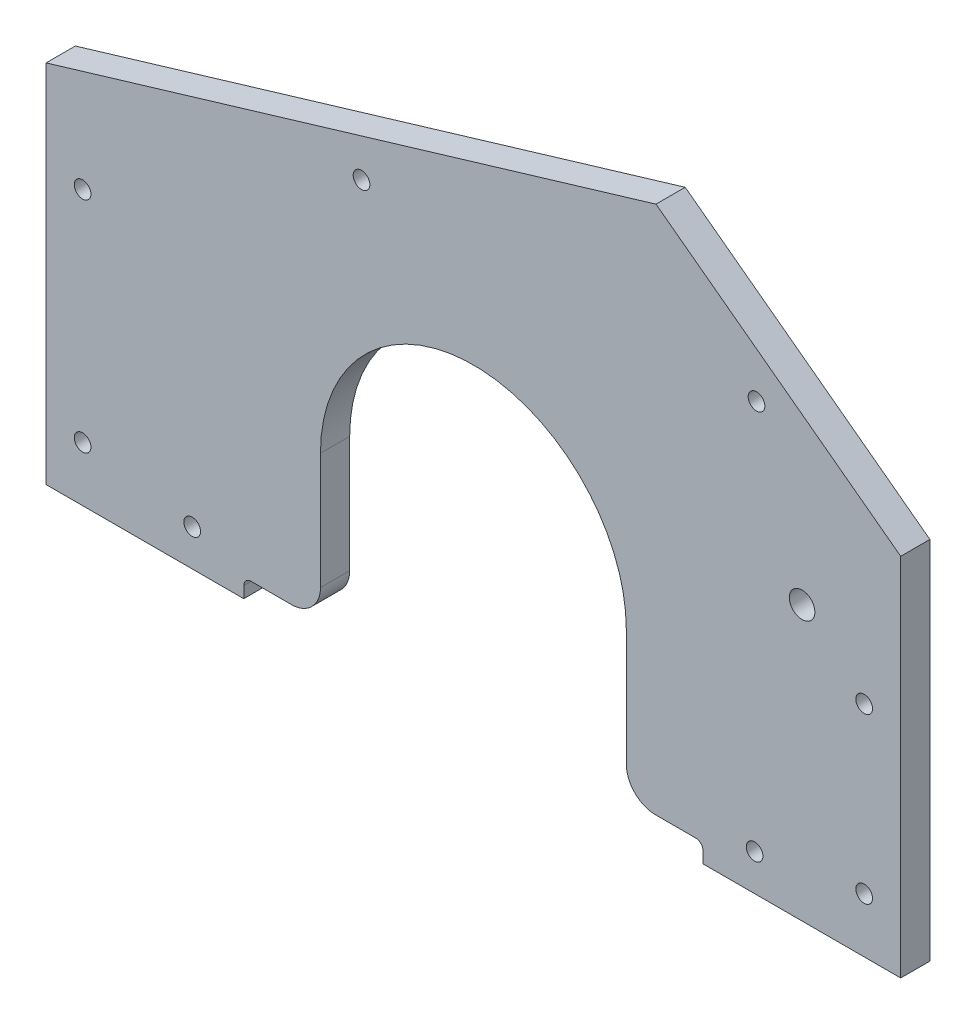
ISO-10303-21;
HEADER;
FILE_DESCRIPTION(('STEP AP214'),'2;1');
FILE_NAME('part.step','',(''),(''),'','','');
FILE_SCHEMA(('AUTOMOTIVE_DESIGN { 1 0 10303 214 1 1 1 1 }'));
ENDSEC;
DATA;
#1=APPLICATION_CONTEXT('core data for automotive mechanical design processes');
#2=APPLICATION_PROTOCOL_DEFINITION('international standard','automotive_design',2000,#1);
#3=PRODUCT_CONTEXT('',#1,'mechanical');
#4=PRODUCT('Part','Part','',(#3));
#5=PRODUCT_RELATED_PRODUCT_CATEGORY('part','',(#4));
#6=PRODUCT_DEFINITION_FORMATION('','',#4);
#7=PRODUCT_DEFINITION_CONTEXT('part definition',#1,'design');
#8=PRODUCT_DEFINITION('design','',#6,#7);
#9=PRODUCT_DEFINITION_SHAPE('','',#8);
#10=(LENGTH_UNIT() NAMED_UNIT(*) SI_UNIT(.MILLI.,.METRE.));
#11=(NAMED_UNIT(*) PLANE_ANGLE_UNIT() SI_UNIT($,.RADIAN.));
#12=(NAMED_UNIT(*) SI_UNIT($,.STERADIAN.) SOLID_ANGLE_UNIT());
#13=UNCERTAINTY_MEASURE_WITH_UNIT(LENGTH_MEASURE(1.E-05),#10,'distance_accuracy_value','');
#14=(GEOMETRIC_REPRESENTATION_CONTEXT(3) GLOBAL_UNCERTAINTY_ASSIGNED_CONTEXT((#13)) GLOBAL_UNIT_ASSIGNED_CONTEXT((#10,
#11,#12)) REPRESENTATION_CONTEXT('',''));
#15=CARTESIAN_POINT('',(0.,0.,0.));
#16=DIRECTION('',(0.,0.,1.));
#17=DIRECTION('',(1.,0.,0.));
#18=AXIS2_PLACEMENT_3D('',#15,#16,#17);
#19=CARTESIAN_POINT('',(98.7933930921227,-69.6734749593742,-8.));
#20=DIRECTION('',(0.,-1.,0.));
#21=DIRECTION('',(1.,0.,0.));
#22=AXIS2_PLACEMENT_3D('',#19,#20,#21);
#23=PLANE('',#22);
#24=DIRECTION('',(1.,0.,0.));
#25=VECTOR('',#24,1.);
#26=CARTESIAN_POINT('',(98.7933930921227,-69.6734749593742,-8.));
#27=LINE('',#26,#25);
#28=CARTESIAN_POINT('',(-135.206606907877,-69.6734749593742,-8.));
#29=VERTEX_POINT('',#28);
#30=CARTESIAN_POINT('',(-81.0816069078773,-69.6734749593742,-8.));
#31=VERTEX_POINT('',#30);
#32=EDGE_CURVE('E379',#29,#31,#27,.T.);
#33=ORIENTED_EDGE('',*,*,#32,.T.);
#34=DIRECTION('',(0.,0.,1.));
#35=VECTOR('',#34,1.);
#36=CARTESIAN_POINT('',(-81.0816069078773,-69.6734749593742,-8.));
#37=LINE('',#36,#35);
#38=CARTESIAN_POINT('',(-81.0816069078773,-69.6734749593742,0.));
#39=VERTEX_POINT('',#38);
#40=EDGE_CURVE('E319',#31,#39,#37,.T.);
#41=ORIENTED_EDGE('',*,*,#40,.T.);
#42=DIRECTION('',(1.,0.,0.));
#43=VECTOR('',#42,1.);
#44=CARTESIAN_POINT('',(98.7933930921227,-69.6734749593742,0.));
#45=LINE('',#44,#43);
#46=CARTESIAN_POINT('',(-135.206606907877,-69.6734749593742,0.));
#47=VERTEX_POINT('',#46);
#48=EDGE_CURVE('E395',#47,#39,#45,.T.);
#49=ORIENTED_EDGE('',*,*,#48,.F.);
#50=DIRECTION('',(0.,0.,1.));
#51=VECTOR('',#50,1.);
#52=CARTESIAN_POINT('',(-135.206606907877,-69.6734749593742,-8.));
#53=LINE('',#52,#51);
#54=EDGE_CURVE('E173',#29,#47,#53,.T.);
#55=ORIENTED_EDGE('',*,*,#54,.F.);
#56=EDGE_LOOP('',(#33,#41,#49,#55));
#57=FACE_BOUND('',#56,.T.);
#58=ADVANCED_FACE('F41',(#57),#23,.T.);
#59=CARTESIAN_POINT('',(44.6683930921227,-69.6734749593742,0.));
#60=VERTEX_POINT('',#59);
#61=CARTESIAN_POINT('',(98.7933930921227,-69.6734749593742,0.));
#62=VERTEX_POINT('',#61);
#63=EDGE_CURVE('E376',#60,#62,#45,.T.);
#64=ORIENTED_EDGE('',*,*,#63,.F.);
#65=DIRECTION('',(0.,0.,-1.));
#66=VECTOR('',#65,1.);
#67=CARTESIAN_POINT('',(44.6683930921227,-69.6734749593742,-8.));
#68=LINE('',#67,#66);
#69=CARTESIAN_POINT('',(44.6683930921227,-69.6734749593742,-8.));
#70=VERTEX_POINT('',#69);
#71=EDGE_CURVE('E314',#60,#70,#68,.T.);
#72=ORIENTED_EDGE('',*,*,#71,.T.);
#73=CARTESIAN_POINT('',(98.7933930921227,-69.6734749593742,-8.));
#74=VERTEX_POINT('',#73);
#75=EDGE_CURVE('E382',#70,#74,#27,.T.);
#76=ORIENTED_EDGE('',*,*,#75,.T.);
#77=DIRECTION('',(0.,0.,1.));
#78=VECTOR('',#77,1.);
#79=CARTESIAN_POINT('',(98.7933930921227,-69.6734749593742,-8.));
#80=LINE('',#79,#78);
#81=EDGE_CURVE('E394',#74,#62,#80,.T.);
#82=ORIENTED_EDGE('',*,*,#81,.T.);
#83=EDGE_LOOP('',(#64,#72,#76,#82));
#84=FACE_BOUND('',#83,.T.);
#85=ADVANCED_FACE('F259',(#84),#23,.T.);
#86=CARTESIAN_POINT('',(0.,0.,-8.));
#87=DIRECTION('',(0.,0.,-1.));
#88=DIRECTION('',(-1.,0.,0.));
#89=AXIS2_PLACEMENT_3D('',#86,#87,#88);
#90=PLANE('',#89);
#91=CARTESIAN_POINT('',(71.7933930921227,5.32652504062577,-8.));
#92=DIRECTION('',(0.,0.,-1.));
#93=DIRECTION('',(-1.,0.,0.));
#94=AXIS2_PLACEMENT_3D('',#91,#92,#93);
#95=CIRCLE('',#94,17.);
#96=CARTESIAN_POINT('',(54.7933930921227,5.32652504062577,-8.));
#97=VERTEX_POINT('',#96);
#98=EDGE_CURVE('E11',#97,#97,#95,.F.);
#99=ORIENTED_EDGE('',*,*,#98,.T.);
#100=EDGE_LOOP('',(#99));
#101=FACE_BOUND('',#100,.T.);
#102=CARTESIAN_POINT('',(88.7933930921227,-9.67347495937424,-8.));
#103=DIRECTION('',(0.,0.,1.));
#104=DIRECTION('',(1.,0.,0.));
#105=AXIS2_PLACEMENT_3D('',#102,#103,#104);
#106=CIRCLE('',#105,2.28499999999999);
#107=CARTESIAN_POINT('',(91.0783930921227,-9.67347495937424,-8.));
#108=VERTEX_POINT('',#107);
#109=EDGE_CURVE('E331',#108,#108,#106,.T.);
#110=ORIENTED_EDGE('',*,*,#109,.T.);
#111=EDGE_LOOP('',(#110));
#112=FACE_BOUND('',#111,.T.);
#113=CARTESIAN_POINT('',(-48.8383912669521,45.7466847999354,-8.));
#114=DIRECTION('',(0.,0.,1.));
#115=DIRECTION('',(1.,0.,0.));
#116=AXIS2_PLACEMENT_3D('',#113,#114,#115);
#117=CIRCLE('',#116,2.285);
#118=CARTESIAN_POINT('',(-46.5533912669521,45.7466847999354,-8.));
#119=VERTEX_POINT('',#118);
#120=EDGE_CURVE('E337',#119,#119,#117,.T.);
#121=ORIENTED_EDGE('',*,*,#120,.T.);
#122=EDGE_LOOP('',(#121));
#123=FACE_BOUND('',#122,.T.);
#124=CARTESIAN_POINT('',(59.3125489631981,47.3121939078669,-8.));
#125=DIRECTION('',(0.,0.,1.));
#126=DIRECTION('',(1.,0.,0.));
#127=AXIS2_PLACEMENT_3D('',#124,#125,#126);
#128=CIRCLE('',#127,2.28499999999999);
#129=CARTESIAN_POINT('',(61.5975489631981,47.3121939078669,-8.));
#130=VERTEX_POINT('',#129);
#131=EDGE_CURVE('E343',#130,#130,#128,.T.);
#132=ORIENTED_EDGE('',*,*,#131,.T.);
#133=EDGE_LOOP('',(#132));
#134=FACE_BOUND('',#133,.T.);
#135=CARTESIAN_POINT('',(88.7933930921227,-54.6734749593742,-8.));
#136=DIRECTION('',(0.,0.,1.));
#137=DIRECTION('',(1.,0.,0.));
#138=AXIS2_PLACEMENT_3D('',#135,#136,#137);
#139=CIRCLE('',#138,2.28499999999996);
#140=CARTESIAN_POINT('',(91.0783930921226,-54.6734749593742,-8.));
#141=VERTEX_POINT('',#140);
#142=EDGE_CURVE('E349',#141,#141,#139,.T.);
#143=ORIENTED_EDGE('',*,*,#142,.T.);
#144=EDGE_LOOP('',(#143));
#145=FACE_BOUND('',#144,.T.);
#146=CARTESIAN_POINT('',(58.7933930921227,-59.6734749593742,-8.));
#147=DIRECTION('',(0.,0.,1.));
#148=DIRECTION('',(-1.,0.,0.));
#149=AXIS2_PLACEMENT_3D('',#146,#147,#148);
#150=CIRCLE('',#149,2.285);
#151=CARTESIAN_POINT('',(56.5083930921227,-59.6734749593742,-8.));
#152=VERTEX_POINT('',#151);
#153=EDGE_CURVE('E355',#152,#152,#150,.T.);
#154=ORIENTED_EDGE('',*,*,#153,.T.);
#155=EDGE_LOOP('',(#154));
#156=FACE_BOUND('',#155,.T.);
#157=CARTESIAN_POINT('',(-95.2066069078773,-59.6734749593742,-8.));
#158=DIRECTION('',(0.,0.,1.));
#159=DIRECTION('',(1.,0.,0.));
#160=AXIS2_PLACEMENT_3D('',#157,#158,#159);
#161=CIRCLE('',#160,2.285);
#162=CARTESIAN_POINT('',(-92.9216069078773,-59.6734749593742,-8.));
#163=VERTEX_POINT('',#162);
#164=EDGE_CURVE('E361',#163,#163,#161,.T.);
#165=ORIENTED_EDGE('',*,*,#164,.T.);
#166=EDGE_LOOP('',(#165));
#167=FACE_BOUND('',#166,.T.);
#168=CARTESIAN_POINT('',(-125.206606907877,-54.6734749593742,-8.));
#169=DIRECTION('',(0.,0.,1.));
#170=DIRECTION('',(-1.,0.,0.));
#171=AXIS2_PLACEMENT_3D('',#168,#169,#170);
#172=CIRCLE('',#171,2.28499999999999);
#173=CARTESIAN_POINT('',(-127.491606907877,-54.6734749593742,-8.));
#174=VERTEX_POINT('',#173);
#175=EDGE_CURVE('E367',#174,#174,#172,.T.);
#176=ORIENTED_EDGE('',*,*,#175,.T.);
#177=EDGE_LOOP('',(#176));
#178=FACE_BOUND('',#177,.T.);
#179=CARTESIAN_POINT('',(-125.206606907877,5.32652504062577,-8.));
#180=DIRECTION('',(0.,0.,1.));
#181=DIRECTION('',(1.,0.,0.));
#182=AXIS2_PLACEMENT_3D('',#179,#180,#181);
#183=CIRCLE('',#182,2.28499999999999);
#184=CARTESIAN_POINT('',(-122.921606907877,5.32652504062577,-8.));
#185=VERTEX_POINT('',#184);
#186=EDGE_CURVE('E373',#185,#185,#183,.T.);
#187=ORIENTED_EDGE('',*,*,#186,.T.);
#188=EDGE_LOOP('',(#187));
#189=FACE_BOUND('',#188,.T.);
#190=DIRECTION('',(0.,-1.,0.));
#191=VECTOR('',#190,1.);
#192=CARTESIAN_POINT('',(-60.0816069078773,0.,-8.));
#193=LINE('',#192,#191);
#194=CARTESIAN_POINT('',(-60.0816069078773,-24.6734749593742,-8.));
#195=VERTEX_POINT('',#194);
#196=CARTESIAN_POINT('',(-60.0816069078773,-56.5434749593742,-8.));
#197=VERTEX_POINT('',#196);
#198=EDGE_CURVE('E303',#195,#197,#193,.T.);
#199=ORIENTED_EDGE('',*,*,#198,.T.);
#200=CARTESIAN_POINT('',(-68.0816069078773,-56.5434749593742,-8.));
#201=DIRECTION('',(0.,0.,-1.));
#202=DIRECTION('',(-1.,0.,0.));
#203=AXIS2_PLACEMENT_3D('',#200,#201,#202);
#204=CIRCLE('',#203,8.);
#205=CARTESIAN_POINT('',(-68.0816069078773,-64.5434749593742,-8.));
#206=VERTEX_POINT('',#205);
#207=EDGE_CURVE('E215',#197,#206,#204,.T.);
#208=ORIENTED_EDGE('',*,*,#207,.T.);
#209=DIRECTION('',(-1.,0.,0.));
#210=VECTOR('',#209,1.);
#211=CARTESIAN_POINT('',(0.,-64.5434749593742,-8.));
#212=LINE('',#211,#210);
#213=CARTESIAN_POINT('',(-79.0816069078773,-64.5434749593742,-8.));
#214=VERTEX_POINT('',#213);
#215=EDGE_CURVE('E298',#206,#214,#212,.T.);
#216=ORIENTED_EDGE('',*,*,#215,.T.);
#217=CARTESIAN_POINT('',(-79.0816069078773,-66.5434749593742,-8.));
#218=DIRECTION('',(0.,0.,-1.));
#219=DIRECTION('',(-1.,0.,0.));
#220=AXIS2_PLACEMENT_3D('',#217,#218,#219);
#221=CIRCLE('',#220,2.);
#222=CARTESIAN_POINT('',(-81.0816069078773,-66.5434749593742,-8.));
#223=VERTEX_POINT('',#222);
#224=EDGE_CURVE('E236',#214,#223,#221,.F.);
#225=ORIENTED_EDGE('',*,*,#224,.T.);
#226=DIRECTION('',(0.,-1.,0.));
#227=VECTOR('',#226,1.);
#228=CARTESIAN_POINT('',(-81.0816069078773,0.,-8.));
#229=LINE('',#228,#227);
#230=EDGE_CURVE('E322',#223,#31,#229,.T.);
#231=ORIENTED_EDGE('',*,*,#230,.T.);
#232=ORIENTED_EDGE('',*,*,#32,.F.);
#233=DIRECTION('',(0.,-1.,0.));
#234=VECTOR('',#233,1.);
#235=CARTESIAN_POINT('',(-135.206606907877,-69.6734749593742,-8.));
#236=LINE('',#235,#234);
#237=CARTESIAN_POINT('',(-135.206606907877,30.3265250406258,-8.));
#238=VERTEX_POINT('',#237);
#239=EDGE_CURVE('E391',#238,#29,#236,.T.);
#240=ORIENTED_EDGE('',*,*,#239,.F.);
#241=DIRECTION('',(-0.957984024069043,-0.286821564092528,0.));
#242=VECTOR('',#241,1.);
#243=CARTESIAN_POINT('',(-135.206606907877,30.3265250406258,-8.));
#244=LINE('',#243,#242);
#245=CARTESIAN_POINT('',(31.7933930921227,80.3265250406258,-8.));
#246=VERTEX_POINT('',#245);
#247=EDGE_CURVE('E388',#246,#238,#244,.T.);
#248=ORIENTED_EDGE('',*,*,#247,.F.);
#249=DIRECTION('',(-0.801433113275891,0.598084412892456,0.));
#250=VECTOR('',#249,1.);
#251=CARTESIAN_POINT('',(31.7933930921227,80.3265250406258,-8.));
#252=LINE('',#251,#250);
#253=CARTESIAN_POINT('',(98.7933930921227,30.3265250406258,-8.));
#254=VERTEX_POINT('',#253);
#255=EDGE_CURVE('E385',#254,#246,#252,.T.);
#256=ORIENTED_EDGE('',*,*,#255,.F.);
#257=DIRECTION('',(0.,1.,0.));
#258=VECTOR('',#257,1.);
#259=CARTESIAN_POINT('',(98.7933930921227,30.3265250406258,-8.));
#260=LINE('',#259,#258);
#261=EDGE_CURVE('E381',#74,#254,#260,.T.);
#262=ORIENTED_EDGE('',*,*,#261,.F.);
#263=ORIENTED_EDGE('',*,*,#75,.F.);
#264=DIRECTION('',(0.,1.,0.));
#265=VECTOR('',#264,1.);
#266=CARTESIAN_POINT('',(44.6683930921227,0.,-8.));
#267=LINE('',#266,#265);
#268=CARTESIAN_POINT('',(44.6683930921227,-66.5434749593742,-8.));
#269=VERTEX_POINT('',#268);
#270=EDGE_CURVE('E317',#70,#269,#267,.T.);
#271=ORIENTED_EDGE('',*,*,#270,.T.);
#272=CARTESIAN_POINT('',(42.6683930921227,-66.5434749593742,-8.));
#273=DIRECTION('',(0.,0.,-1.));
#274=DIRECTION('',(-1.,0.,0.));
#275=AXIS2_PLACEMENT_3D('',#272,#273,#274);
#276=CIRCLE('',#275,2.);
#277=CARTESIAN_POINT('',(42.6683930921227,-64.5434749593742,-8.));
#278=VERTEX_POINT('',#277);
#279=EDGE_CURVE('E57',#269,#278,#276,.F.);
#280=ORIENTED_EDGE('',*,*,#279,.T.);
#281=DIRECTION('',(-1.,0.,0.));
#282=VECTOR('',#281,1.);
#283=CARTESIAN_POINT('',(0.,-64.5434749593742,-8.));
#284=LINE('',#283,#282);
#285=CARTESIAN_POINT('',(31.6683930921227,-64.5434749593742,-8.));
#286=VERTEX_POINT('',#285);
#287=EDGE_CURVE('E312',#278,#286,#284,.T.);
#288=ORIENTED_EDGE('',*,*,#287,.T.);
#289=CARTESIAN_POINT('',(31.6683930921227,-56.5434749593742,-8.));
#290=DIRECTION('',(0.,0.,-1.));
#291=DIRECTION('',(-1.,0.,0.));
#292=AXIS2_PLACEMENT_3D('',#289,#290,#291);
#293=CIRCLE('',#292,8.);
#294=CARTESIAN_POINT('',(23.6683930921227,-56.5434749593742,-8.));
#295=VERTEX_POINT('',#294);
#296=EDGE_CURVE('E213',#286,#295,#293,.T.);
#297=ORIENTED_EDGE('',*,*,#296,.T.);
#298=DIRECTION('',(0.,1.,0.));
#299=VECTOR('',#298,1.);
#300=CARTESIAN_POINT('',(23.6683930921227,0.,-8.));
#301=LINE('',#300,#299);
#302=CARTESIAN_POINT('',(23.6683930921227,-24.6734749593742,-8.));
#303=VERTEX_POINT('',#302);
#304=EDGE_CURVE('E307',#295,#303,#301,.T.);
#305=ORIENTED_EDGE('',*,*,#304,.T.);
#306=CARTESIAN_POINT('',(-18.2066069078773,-24.6734749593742,-8.));
#307=DIRECTION('',(0.,0.,-1.));
#308=DIRECTION('',(-1.,0.,0.));
#309=AXIS2_PLACEMENT_3D('',#306,#307,#308);
#310=CIRCLE('',#309,41.875);
#311=EDGE_CURVE('E182',#303,#195,#310,.F.);
#312=ORIENTED_EDGE('',*,*,#311,.T.);
#313=EDGE_LOOP('',(#199,#208,#216,#225,#231,#232,#240,#248,#256,#262,#263,#271,#280,#288,#297,
#305,#312));
#314=FACE_BOUND('',#313,.T.);
#315=ADVANCED_FACE('F266',(#101,#112,#123,#134,#145,#156,#167,#178,#189,#314),#90,.T.);
#316=CARTESIAN_POINT('',(-135.206606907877,-69.6734749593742,-8.));
#317=DIRECTION('',(-1.,0.,0.));
#318=DIRECTION('',(0.,-1.,0.));
#319=AXIS2_PLACEMENT_3D('',#316,#317,#318);
#320=PLANE('',#319);
#321=DIRECTION('',(0.,-1.,0.));
#322=VECTOR('',#321,1.);
#323=CARTESIAN_POINT('',(-135.206606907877,-69.6734749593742,0.));
#324=LINE('',#323,#322);
#325=CARTESIAN_POINT('',(-135.206606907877,30.3265250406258,0.));
#326=VERTEX_POINT('',#325);
#327=EDGE_CURVE('E406',#326,#47,#324,.T.);
#328=ORIENTED_EDGE('',*,*,#327,.F.);
#329=DIRECTION('',(0.,0.,1.));
#330=VECTOR('',#329,1.);
#331=CARTESIAN_POINT('',(-135.206606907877,30.3265250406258,-8.));
#332=LINE('',#331,#330);
#333=EDGE_CURVE('E410',#238,#326,#332,.T.);
#334=ORIENTED_EDGE('',*,*,#333,.F.);
#335=ORIENTED_EDGE('',*,*,#239,.T.);
#336=ORIENTED_EDGE('',*,*,#54,.T.);
#337=EDGE_LOOP('',(#328,#334,#335,#336));
#338=FACE_BOUND('',#337,.T.);
#339=ADVANCED_FACE('F442',(#338),#320,.T.);
#340=CARTESIAN_POINT('',(-135.206606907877,30.3265250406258,-8.));
#341=DIRECTION('',(-0.286821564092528,0.957984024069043,0.));
#342=DIRECTION('',(-0.957984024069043,-0.286821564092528,0.));
#343=AXIS2_PLACEMENT_3D('',#340,#341,#342);
#344=PLANE('',#343);
#345=DIRECTION('',(-0.957984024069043,-0.286821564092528,0.));
#346=VECTOR('',#345,1.);
#347=CARTESIAN_POINT('',(-135.206606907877,30.3265250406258,0.));
#348=LINE('',#347,#346);
#349=CARTESIAN_POINT('',(31.7933930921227,80.3265250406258,0.));
#350=VERTEX_POINT('',#349);
#351=EDGE_CURVE('E403',#350,#326,#348,.T.);
#352=ORIENTED_EDGE('',*,*,#351,.F.);
#353=DIRECTION('',(0.,0.,1.));
#354=VECTOR('',#353,1.);
#355=CARTESIAN_POINT('',(31.7933930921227,80.3265250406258,-8.));
#356=LINE('',#355,#354);
#357=EDGE_CURVE('E412',#246,#350,#356,.T.);
#358=ORIENTED_EDGE('',*,*,#357,.F.);
#359=ORIENTED_EDGE('',*,*,#247,.T.);
#360=ORIENTED_EDGE('',*,*,#333,.T.);
#361=EDGE_LOOP('',(#352,#358,#359,#360));
#362=FACE_BOUND('',#361,.T.);
#363=ADVANCED_FACE('F439',(#362),#344,.T.);
#364=CARTESIAN_POINT('',(31.7933930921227,80.3265250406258,-8.));
#365=DIRECTION('',(0.598084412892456,0.801433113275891,0.));
#366=DIRECTION('',(-0.801433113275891,0.598084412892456,0.));
#367=AXIS2_PLACEMENT_3D('',#364,#365,#366);
#368=PLANE('',#367);
#369=DIRECTION('',(-0.801433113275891,0.598084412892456,0.));
#370=VECTOR('',#369,1.);
#371=CARTESIAN_POINT('',(31.7933930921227,80.3265250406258,0.));
#372=LINE('',#371,#370);
#373=CARTESIAN_POINT('',(98.7933930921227,30.3265250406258,0.));
#374=VERTEX_POINT('',#373);
#375=EDGE_CURVE('E400',#374,#350,#372,.T.);
#376=ORIENTED_EDGE('',*,*,#375,.F.);
#377=DIRECTION('',(0.,0.,1.));
#378=VECTOR('',#377,1.);
#379=CARTESIAN_POINT('',(98.7933930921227,30.3265250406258,-8.));
#380=LINE('',#379,#378);
#381=EDGE_CURVE('E414',#254,#374,#380,.T.);
#382=ORIENTED_EDGE('',*,*,#381,.F.);
#383=ORIENTED_EDGE('',*,*,#255,.T.);
#384=ORIENTED_EDGE('',*,*,#357,.T.);
#385=EDGE_LOOP('',(#376,#382,#383,#384));
#386=FACE_BOUND('',#385,.T.);
#387=ADVANCED_FACE('F437',(#386),#368,.T.);
#388=CARTESIAN_POINT('',(98.7933930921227,30.3265250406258,-8.));
#389=DIRECTION('',(1.,0.,0.));
#390=DIRECTION('',(0.,1.,0.));
#391=AXIS2_PLACEMENT_3D('',#388,#389,#390);
#392=PLANE('',#391);
#393=DIRECTION('',(0.,1.,0.));
#394=VECTOR('',#393,1.);
#395=CARTESIAN_POINT('',(98.7933930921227,30.3265250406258,0.));
#396=LINE('',#395,#394);
#397=EDGE_CURVE('E397',#62,#374,#396,.T.);
#398=ORIENTED_EDGE('',*,*,#397,.F.);
#399=ORIENTED_EDGE('',*,*,#81,.F.);
#400=ORIENTED_EDGE('',*,*,#261,.T.);
#401=ORIENTED_EDGE('',*,*,#381,.T.);
#402=EDGE_LOOP('',(#398,#399,#400,#401));
#403=FACE_BOUND('',#402,.T.);
#404=ADVANCED_FACE('F271',(#403),#392,.T.);
#405=CARTESIAN_POINT('',(0.,0.,0.));
#406=DIRECTION('',(0.,0.,-1.));
#407=DIRECTION('',(-1.,0.,0.));
#408=AXIS2_PLACEMENT_3D('',#405,#406,#407);
#409=PLANE('',#408);
#410=DIRECTION('',(-1.,0.,0.));
#411=VECTOR('',#410,1.);
#412=CARTESIAN_POINT('',(0.,-64.5434749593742,0.));
#413=LINE('',#412,#411);
#414=CARTESIAN_POINT('',(-68.0816069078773,-64.5434749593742,0.));
#415=VERTEX_POINT('',#414);
#416=CARTESIAN_POINT('',(-79.0816069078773,-64.5434749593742,0.));
#417=VERTEX_POINT('',#416);
#418=EDGE_CURVE('E194',#415,#417,#413,.T.);
#419=ORIENTED_EDGE('',*,*,#418,.F.);
#420=CARTESIAN_POINT('',(-68.0816069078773,-56.5434749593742,0.));
#421=DIRECTION('',(0.,0.,-1.));
#422=DIRECTION('',(-1.,0.,0.));
#423=AXIS2_PLACEMENT_3D('',#420,#421,#422);
#424=CIRCLE('',#423,8.);
#425=CARTESIAN_POINT('',(-60.0816069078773,-56.5434749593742,0.));
#426=VERTEX_POINT('',#425);
#427=EDGE_CURVE('E221',#415,#426,#424,.F.);
#428=ORIENTED_EDGE('',*,*,#427,.T.);
#429=DIRECTION('',(0.,-1.,0.));
#430=VECTOR('',#429,1.);
#431=CARTESIAN_POINT('',(-60.0816069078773,0.,0.));
#432=LINE('',#431,#430);
#433=CARTESIAN_POINT('',(-60.0816069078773,-24.6734749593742,0.));
#434=VERTEX_POINT('',#433);
#435=EDGE_CURVE('E191',#434,#426,#432,.T.);
#436=ORIENTED_EDGE('',*,*,#435,.F.);
#437=CARTESIAN_POINT('',(-18.2066069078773,-24.6734749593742,0.));
#438=DIRECTION('',(0.,0.,-1.));
#439=DIRECTION('',(-1.,0.,0.));
#440=AXIS2_PLACEMENT_3D('',#437,#438,#439);
#441=CIRCLE('',#440,41.875);
#442=CARTESIAN_POINT('',(23.6683930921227,-24.6734749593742,0.));
#443=VERTEX_POINT('',#442);
#444=EDGE_CURVE('E179',#443,#434,#441,.F.);
#445=ORIENTED_EDGE('',*,*,#444,.F.);
#446=DIRECTION('',(0.,1.,0.));
#447=VECTOR('',#446,1.);
#448=CARTESIAN_POINT('',(23.6683930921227,0.,0.));
#449=LINE('',#448,#447);
#450=CARTESIAN_POINT('',(23.6683930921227,-56.5434749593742,0.));
#451=VERTEX_POINT('',#450);
#452=EDGE_CURVE('E161',#451,#443,#449,.T.);
#453=ORIENTED_EDGE('',*,*,#452,.F.);
#454=CARTESIAN_POINT('',(31.6683930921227,-56.5434749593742,0.));
#455=DIRECTION('',(0.,0.,-1.));
#456=DIRECTION('',(-1.,0.,0.));
#457=AXIS2_PLACEMENT_3D('',#454,#455,#456);
#458=CIRCLE('',#457,8.);
#459=CARTESIAN_POINT('',(31.6683930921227,-64.5434749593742,0.));
#460=VERTEX_POINT('',#459);
#461=EDGE_CURVE('E219',#451,#460,#458,.F.);
#462=ORIENTED_EDGE('',*,*,#461,.T.);
#463=DIRECTION('',(-1.,0.,0.));
#464=VECTOR('',#463,1.);
#465=CARTESIAN_POINT('',(0.,-64.5434749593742,0.));
#466=LINE('',#465,#464);
#467=CARTESIAN_POINT('',(42.6683930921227,-64.5434749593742,0.));
#468=VERTEX_POINT('',#467);
#469=EDGE_CURVE('E172',#468,#460,#466,.T.);
#470=ORIENTED_EDGE('',*,*,#469,.F.);
#471=CARTESIAN_POINT('',(42.6683930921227,-66.5434749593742,0.));
#472=DIRECTION('',(0.,0.,-1.));
#473=DIRECTION('',(-1.,0.,0.));
#474=AXIS2_PLACEMENT_3D('',#471,#472,#473);
#475=CIRCLE('',#474,2.);
#476=CARTESIAN_POINT('',(44.6683930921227,-66.5434749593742,0.));
#477=VERTEX_POINT('',#476);
#478=EDGE_CURVE('E241',#468,#477,#475,.T.);
#479=ORIENTED_EDGE('',*,*,#478,.T.);
#480=DIRECTION('',(0.,1.,0.));
#481=VECTOR('',#480,1.);
#482=CARTESIAN_POINT('',(44.6683930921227,0.,0.));
#483=LINE('',#482,#481);
#484=EDGE_CURVE('E192',#60,#477,#483,.T.);
#485=ORIENTED_EDGE('',*,*,#484,.F.);
#486=ORIENTED_EDGE('',*,*,#63,.T.);
#487=ORIENTED_EDGE('',*,*,#397,.T.);
#488=ORIENTED_EDGE('',*,*,#375,.T.);
#489=ORIENTED_EDGE('',*,*,#351,.T.);
#490=ORIENTED_EDGE('',*,*,#327,.T.);
#491=ORIENTED_EDGE('',*,*,#48,.T.);
#492=DIRECTION('',(0.,-1.,0.));
#493=VECTOR('',#492,1.);
#494=CARTESIAN_POINT('',(-81.0816069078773,0.,0.));
#495=LINE('',#494,#493);
#496=CARTESIAN_POINT('',(-81.0816069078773,-66.5434749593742,0.));
#497=VERTEX_POINT('',#496);
#498=EDGE_CURVE('E202',#497,#39,#495,.T.);
#499=ORIENTED_EDGE('',*,*,#498,.F.);
#500=CARTESIAN_POINT('',(-79.0816069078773,-66.5434749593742,0.));
#501=DIRECTION('',(0.,0.,-1.));
#502=DIRECTION('',(-1.,0.,0.));
#503=AXIS2_PLACEMENT_3D('',#500,#501,#502);
#504=CIRCLE('',#503,2.);
#505=EDGE_CURVE('E238',#497,#417,#504,.T.);
#506=ORIENTED_EDGE('',*,*,#505,.T.);
#507=EDGE_LOOP('',(#419,#428,#436,#445,#453,#462,#470,#479,#485,#486,#487,#488,#489,#490,#491,
#499,#506));
#508=FACE_BOUND('',#507,.T.);
#509=CARTESIAN_POINT('',(71.7933930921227,5.32652504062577,0.));
#510=DIRECTION('',(0.,0.,-1.));
#511=DIRECTION('',(-1.,0.,0.));
#512=AXIS2_PLACEMENT_3D('',#509,#510,#511);
#513=CIRCLE('',#512,3.50000000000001);
#514=CARTESIAN_POINT('',(68.2933930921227,5.32652504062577,0.));
#515=VERTEX_POINT('',#514);
#516=EDGE_CURVE('E304',#515,#515,#513,.F.);
#517=ORIENTED_EDGE('',*,*,#516,.F.);
#518=EDGE_LOOP('',(#517));
#519=FACE_BOUND('',#518,.T.);
#520=CARTESIAN_POINT('',(88.7933930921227,-9.67347495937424,0.));
#521=DIRECTION('',(0.,0.,1.));
#522=DIRECTION('',(1.,0.,0.));
#523=AXIS2_PLACEMENT_3D('',#520,#521,#522);
#524=CIRCLE('',#523,2.28499999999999);
#525=CARTESIAN_POINT('',(91.0783930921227,-9.67347495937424,0.));
#526=VERTEX_POINT('',#525);
#527=EDGE_CURVE('E330',#526,#526,#524,.T.);
#528=ORIENTED_EDGE('',*,*,#527,.F.);
#529=EDGE_LOOP('',(#528));
#530=FACE_BOUND('',#529,.T.);
#531=CARTESIAN_POINT('',(-48.8383912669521,45.7466847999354,0.));
#532=DIRECTION('',(0.,0.,1.));
#533=DIRECTION('',(1.,0.,0.));
#534=AXIS2_PLACEMENT_3D('',#531,#532,#533);
#535=CIRCLE('',#534,2.285);
#536=CARTESIAN_POINT('',(-46.5533912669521,45.7466847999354,0.));
#537=VERTEX_POINT('',#536);
#538=EDGE_CURVE('E334',#537,#537,#535,.T.);
#539=ORIENTED_EDGE('',*,*,#538,.F.);
#540=EDGE_LOOP('',(#539));
#541=FACE_BOUND('',#540,.T.);
#542=CARTESIAN_POINT('',(59.3125489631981,47.3121939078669,0.));
#543=DIRECTION('',(0.,0.,1.));
#544=DIRECTION('',(1.,0.,0.));
#545=AXIS2_PLACEMENT_3D('',#542,#543,#544);
#546=CIRCLE('',#545,2.28499999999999);
#547=CARTESIAN_POINT('',(61.5975489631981,47.3121939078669,0.));
#548=VERTEX_POINT('',#547);
#549=EDGE_CURVE('E340',#548,#548,#546,.T.);
#550=ORIENTED_EDGE('',*,*,#549,.F.);
#551=EDGE_LOOP('',(#550));
#552=FACE_BOUND('',#551,.T.);
#553=CARTESIAN_POINT('',(88.7933930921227,-54.6734749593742,0.));
#554=DIRECTION('',(0.,0.,1.));
#555=DIRECTION('',(1.,0.,0.));
#556=AXIS2_PLACEMENT_3D('',#553,#554,#555);
#557=CIRCLE('',#556,2.28499999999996);
#558=CARTESIAN_POINT('',(91.0783930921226,-54.6734749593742,0.));
#559=VERTEX_POINT('',#558);
#560=EDGE_CURVE('E346',#559,#559,#557,.T.);
#561=ORIENTED_EDGE('',*,*,#560,.F.);
#562=EDGE_LOOP('',(#561));
#563=FACE_BOUND('',#562,.T.);
#564=CARTESIAN_POINT('',(58.7933930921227,-59.6734749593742,0.));
#565=DIRECTION('',(0.,0.,1.));
#566=DIRECTION('',(-1.,0.,0.));
#567=AXIS2_PLACEMENT_3D('',#564,#565,#566);
#568=CIRCLE('',#567,2.285);
#569=CARTESIAN_POINT('',(56.5083930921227,-59.6734749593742,0.));
#570=VERTEX_POINT('',#569);
#571=EDGE_CURVE('E352',#570,#570,#568,.T.);
#572=ORIENTED_EDGE('',*,*,#571,.F.);
#573=EDGE_LOOP('',(#572));
#574=FACE_BOUND('',#573,.T.);
#575=CARTESIAN_POINT('',(-95.2066069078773,-59.6734749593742,0.));
#576=DIRECTION('',(0.,0.,1.));
#577=DIRECTION('',(1.,0.,0.));
#578=AXIS2_PLACEMENT_3D('',#575,#576,#577);
#579=CIRCLE('',#578,2.285);
#580=CARTESIAN_POINT('',(-92.9216069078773,-59.6734749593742,0.));
#581=VERTEX_POINT('',#580);
#582=EDGE_CURVE('E358',#581,#581,#579,.T.);
#583=ORIENTED_EDGE('',*,*,#582,.F.);
#584=EDGE_LOOP('',(#583));
#585=FACE_BOUND('',#584,.T.);
#586=CARTESIAN_POINT('',(-125.206606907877,-54.6734749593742,0.));
#587=DIRECTION('',(0.,0.,1.));
#588=DIRECTION('',(-1.,0.,0.));
#589=AXIS2_PLACEMENT_3D('',#586,#587,#588);
#590=CIRCLE('',#589,2.28499999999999);
#591=CARTESIAN_POINT('',(-127.491606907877,-54.6734749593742,0.));
#592=VERTEX_POINT('',#591);
#593=EDGE_CURVE('E364',#592,#592,#590,.T.);
#594=ORIENTED_EDGE('',*,*,#593,.F.);
#595=EDGE_LOOP('',(#594));
#596=FACE_BOUND('',#595,.T.);
#597=CARTESIAN_POINT('',(-125.206606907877,5.32652504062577,0.));
#598=DIRECTION('',(0.,0.,1.));
#599=DIRECTION('',(1.,0.,0.));
#600=AXIS2_PLACEMENT_3D('',#597,#598,#599);
#601=CIRCLE('',#600,2.28499999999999);
#602=CARTESIAN_POINT('',(-122.921606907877,5.32652504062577,0.));
#603=VERTEX_POINT('',#602);
#604=EDGE_CURVE('E370',#603,#603,#601,.T.);
#605=ORIENTED_EDGE('',*,*,#604,.F.);
#606=EDGE_LOOP('',(#605));
#607=FACE_BOUND('',#606,.T.);
#608=ADVANCED_FACE('F188',(#508,#519,#530,#541,#552,#563,#574,#585,#596,#607),#409,.F.);
#609=CARTESIAN_POINT('',(-125.206606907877,5.32652504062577,-8.));
#610=DIRECTION('',(0.,0.,1.));
#611=DIRECTION('',(1.,0.,0.));
#612=AXIS2_PLACEMENT_3D('',#609,#610,#611);
#613=CYLINDRICAL_SURFACE('',#612,2.28499999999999);
#614=ORIENTED_EDGE('',*,*,#186,.F.);
#615=EDGE_LOOP('',(#614));
#616=FACE_BOUND('',#615,.T.);
#617=ORIENTED_EDGE('',*,*,#604,.T.);
#618=EDGE_LOOP('',(#617));
#619=FACE_BOUND('',#618,.T.);
#620=ADVANCED_FACE('F501',(#616,#619),#613,.F.);
#621=CARTESIAN_POINT('',(-125.206606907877,-54.6734749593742,-8.));
#622=DIRECTION('',(0.,0.,1.));
#623=DIRECTION('',(1.,0.,0.));
#624=AXIS2_PLACEMENT_3D('',#621,#622,#623);
#625=CYLINDRICAL_SURFACE('',#624,2.28499999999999);
#626=ORIENTED_EDGE('',*,*,#175,.F.);
#627=EDGE_LOOP('',(#626));
#628=FACE_BOUND('',#627,.T.);
#629=ORIENTED_EDGE('',*,*,#593,.T.);
#630=EDGE_LOOP('',(#629));
#631=FACE_BOUND('',#630,.T.);
#632=ADVANCED_FACE('F497',(#628,#631),#625,.F.);
#633=CARTESIAN_POINT('',(-95.2066069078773,-59.6734749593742,-8.));
#634=DIRECTION('',(0.,0.,1.));
#635=DIRECTION('',(1.,0.,0.));
#636=AXIS2_PLACEMENT_3D('',#633,#634,#635);
#637=CYLINDRICAL_SURFACE('',#636,2.285);
#638=ORIENTED_EDGE('',*,*,#164,.F.);
#639=EDGE_LOOP('',(#638));
#640=FACE_BOUND('',#639,.T.);
#641=ORIENTED_EDGE('',*,*,#582,.T.);
#642=EDGE_LOOP('',(#641));
#643=FACE_BOUND('',#642,.T.);
#644=ADVANCED_FACE('F493',(#640,#643),#637,.F.);
#645=CARTESIAN_POINT('',(58.7933930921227,-59.6734749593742,-8.));
#646=DIRECTION('',(0.,0.,1.));
#647=DIRECTION('',(1.,0.,0.));
#648=AXIS2_PLACEMENT_3D('',#645,#646,#647);
#649=CYLINDRICAL_SURFACE('',#648,2.285);
#650=ORIENTED_EDGE('',*,*,#153,.F.);
#651=EDGE_LOOP('',(#650));
#652=FACE_BOUND('',#651,.T.);
#653=ORIENTED_EDGE('',*,*,#571,.T.);
#654=EDGE_LOOP('',(#653));
#655=FACE_BOUND('',#654,.T.);
#656=ADVANCED_FACE('F489',(#652,#655),#649,.F.);
#657=CARTESIAN_POINT('',(88.7933930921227,-54.6734749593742,-8.));
#658=DIRECTION('',(0.,0.,1.));
#659=DIRECTION('',(1.,0.,0.));
#660=AXIS2_PLACEMENT_3D('',#657,#658,#659);
#661=CYLINDRICAL_SURFACE('',#660,2.28499999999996);
#662=ORIENTED_EDGE('',*,*,#142,.F.);
#663=EDGE_LOOP('',(#662));
#664=FACE_BOUND('',#663,.T.);
#665=ORIENTED_EDGE('',*,*,#560,.T.);
#666=EDGE_LOOP('',(#665));
#667=FACE_BOUND('',#666,.T.);
#668=ADVANCED_FACE('F485',(#664,#667),#661,.F.);
#669=CARTESIAN_POINT('',(59.3125489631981,47.3121939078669,-8.));
#670=DIRECTION('',(0.,0.,1.));
#671=DIRECTION('',(1.,0.,0.));
#672=AXIS2_PLACEMENT_3D('',#669,#670,#671);
#673=CYLINDRICAL_SURFACE('',#672,2.28499999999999);
#674=ORIENTED_EDGE('',*,*,#131,.F.);
#675=EDGE_LOOP('',(#674));
#676=FACE_BOUND('',#675,.T.);
#677=ORIENTED_EDGE('',*,*,#549,.T.);
#678=EDGE_LOOP('',(#677));
#679=FACE_BOUND('',#678,.T.);
#680=ADVANCED_FACE('F481',(#676,#679),#673,.F.);
#681=CARTESIAN_POINT('',(-48.8383912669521,45.7466847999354,-8.));
#682=DIRECTION('',(0.,0.,1.));
#683=DIRECTION('',(1.,0.,0.));
#684=AXIS2_PLACEMENT_3D('',#681,#682,#683);
#685=CYLINDRICAL_SURFACE('',#684,2.285);
#686=ORIENTED_EDGE('',*,*,#120,.F.);
#687=EDGE_LOOP('',(#686));
#688=FACE_BOUND('',#687,.T.);
#689=ORIENTED_EDGE('',*,*,#538,.T.);
#690=EDGE_LOOP('',(#689));
#691=FACE_BOUND('',#690,.T.);
#692=ADVANCED_FACE('F477',(#688,#691),#685,.F.);
#693=CARTESIAN_POINT('',(88.7933930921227,-9.67347495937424,-8.));
#694=DIRECTION('',(0.,0.,1.));
#695=DIRECTION('',(1.,0.,0.));
#696=AXIS2_PLACEMENT_3D('',#693,#694,#695);
#697=CYLINDRICAL_SURFACE('',#696,2.28499999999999);
#698=ORIENTED_EDGE('',*,*,#109,.F.);
#699=EDGE_LOOP('',(#698));
#700=FACE_BOUND('',#699,.T.);
#701=ORIENTED_EDGE('',*,*,#527,.T.);
#702=EDGE_LOOP('',(#701));
#703=FACE_BOUND('',#702,.T.);
#704=ADVANCED_FACE('F475',(#700,#703),#697,.F.);
#705=CARTESIAN_POINT('',(71.7933930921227,5.32652504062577,-15.));
#706=DIRECTION('',(0.,0.,1.));
#707=DIRECTION('',(1.,0.,0.));
#708=AXIS2_PLACEMENT_3D('',#705,#706,#707);
#709=CYLINDRICAL_SURFACE('',#708,15.);
#710=CARTESIAN_POINT('',(71.7933930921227,5.32652504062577,-10.));
#711=DIRECTION('',(0.,0.,-1.));
#712=DIRECTION('',(-1.,0.,0.));
#713=AXIS2_PLACEMENT_3D('',#710,#711,#712);
#714=CIRCLE('',#713,15.);
#715=CARTESIAN_POINT('',(56.7933930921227,5.32652504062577,-10.));
#716=VERTEX_POINT('',#715);
#717=EDGE_CURVE('E50',#716,#716,#714,.T.);
#718=ORIENTED_EDGE('',*,*,#717,.T.);
#719=EDGE_LOOP('',(#718));
#720=FACE_BOUND('',#719,.T.);
#721=CARTESIAN_POINT('',(71.7933930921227,5.32652504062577,-15.));
#722=DIRECTION('',(0.,0.,1.));
#723=DIRECTION('',(1.,0.,0.));
#724=AXIS2_PLACEMENT_3D('',#721,#722,#723);
#725=CIRCLE('',#724,15.);
#726=CARTESIAN_POINT('',(86.7933930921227,5.32652504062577,-15.));
#727=VERTEX_POINT('',#726);
#728=EDGE_CURVE('E327',#727,#727,#725,.T.);
#729=ORIENTED_EDGE('',*,*,#728,.T.);
#730=EDGE_LOOP('',(#729));
#731=FACE_BOUND('',#730,.T.);
#732=ADVANCED_FACE('F245',(#720,#731),#709,.T.);
#733=CARTESIAN_POINT('',(71.7933930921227,5.32652504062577,-15.));
#734=DIRECTION('',(0.,0.,1.));
#735=DIRECTION('',(1.,0.,0.));
#736=AXIS2_PLACEMENT_3D('',#733,#734,#735);
#737=PLANE('',#736);
#738=CARTESIAN_POINT('',(71.7933930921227,5.32652504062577,-15.));
#739=DIRECTION('',(0.,0.,1.));
#740=DIRECTION('',(1.,0.,0.));
#741=AXIS2_PLACEMENT_3D('',#738,#739,#740);
#742=CIRCLE('',#741,7.73749999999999);
#743=CARTESIAN_POINT('',(79.5308930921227,5.32652504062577,-15.));
#744=VERTEX_POINT('',#743);
#745=EDGE_CURVE('E184',#744,#744,#742,.T.);
#746=ORIENTED_EDGE('',*,*,#745,.T.);
#747=EDGE_LOOP('',(#746));
#748=FACE_BOUND('',#747,.T.);
#749=ORIENTED_EDGE('',*,*,#728,.F.);
#750=EDGE_LOOP('',(#749));
#751=FACE_BOUND('',#750,.T.);
#752=ADVANCED_FACE('F469',(#748,#751),#737,.F.);
#753=CARTESIAN_POINT('',(71.7933930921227,5.32652504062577,2.));
#754=DIRECTION('',(0.,0.,-1.));
#755=DIRECTION('',(-1.,0.,0.));
#756=AXIS2_PLACEMENT_3D('',#753,#754,#755);
#757=CYLINDRICAL_SURFACE('',#756,3.50000000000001);
#758=CARTESIAN_POINT('',(71.7933930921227,5.32652504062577,-10.222));
#759=DIRECTION('',(0.,0.,1.));
#760=DIRECTION('',(1.,0.,0.));
#761=AXIS2_PLACEMENT_3D('',#758,#759,#760);
#762=CIRCLE('',#761,3.50000000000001);
#763=CARTESIAN_POINT('',(75.2933930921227,5.32652504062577,-10.222));
#764=VERTEX_POINT('',#763);
#765=EDGE_CURVE('E205',#764,#764,#762,.T.);
#766=ORIENTED_EDGE('',*,*,#765,.F.);
#767=EDGE_LOOP('',(#766));
#768=FACE_BOUND('',#767,.T.);
#769=ORIENTED_EDGE('',*,*,#516,.T.);
#770=EDGE_LOOP('',(#769));
#771=FACE_BOUND('',#770,.T.);
#772=ADVANCED_FACE('F466',(#768,#771),#757,.F.);
#773=CARTESIAN_POINT('',(-18.2066069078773,-24.6734749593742,2.));
#774=DIRECTION('',(0.,0.,-1.));
#775=DIRECTION('',(-1.,0.,0.));
#776=AXIS2_PLACEMENT_3D('',#773,#774,#775);
#777=CYLINDRICAL_SURFACE('',#776,41.875);
#778=DIRECTION('',(0.,0.,-1.));
#779=VECTOR('',#778,1.);
#780=CARTESIAN_POINT('',(23.6683930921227,-24.6734749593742,2.));
#781=LINE('',#780,#779);
#782=EDGE_CURVE('E165',#443,#303,#781,.T.);
#783=ORIENTED_EDGE('',*,*,#782,.F.);
#784=ORIENTED_EDGE('',*,*,#444,.T.);
#785=DIRECTION('',(0.,0.,-1.));
#786=VECTOR('',#785,1.);
#787=CARTESIAN_POINT('',(-60.0816069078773,-24.6734749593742,2.));
#788=LINE('',#787,#786);
#789=EDGE_CURVE('E183',#434,#195,#788,.T.);
#790=ORIENTED_EDGE('',*,*,#789,.T.);
#791=ORIENTED_EDGE('',*,*,#311,.F.);
#792=EDGE_LOOP('',(#783,#784,#790,#791));
#793=FACE_BOUND('',#792,.T.);
#794=ADVANCED_FACE('F177',(#793),#777,.F.);
#795=CARTESIAN_POINT('',(-60.0816069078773,-64.5434749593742,2.));
#796=DIRECTION('',(1.,0.,0.));
#797=DIRECTION('',(0.,1.,0.));
#798=AXIS2_PLACEMENT_3D('',#795,#796,#797);
#799=PLANE('',#798);
#800=ORIENTED_EDGE('',*,*,#435,.T.);
#801=DIRECTION('',(0.,0.,-1.));
#802=VECTOR('',#801,1.);
#803=CARTESIAN_POINT('',(-60.0816069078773,-56.5434749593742,2.));
#804=LINE('',#803,#802);
#805=EDGE_CURVE('E204',#426,#197,#804,.T.);
#806=ORIENTED_EDGE('',*,*,#805,.T.);
#807=ORIENTED_EDGE('',*,*,#198,.F.);
#808=ORIENTED_EDGE('',*,*,#789,.F.);
#809=EDGE_LOOP('',(#800,#806,#807,#808));
#810=FACE_BOUND('',#809,.T.);
#811=ADVANCED_FACE('F301',(#810),#799,.T.);
#812=CARTESIAN_POINT('',(-81.0816069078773,-64.5434749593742,2.));
#813=DIRECTION('',(0.,-1.,0.));
#814=DIRECTION('',(1.,0.,0.));
#815=AXIS2_PLACEMENT_3D('',#812,#813,#814);
#816=PLANE('',#815);
#817=ORIENTED_EDGE('',*,*,#418,.T.);
#818=DIRECTION('',(0.,0.,-1.));
#819=VECTOR('',#818,1.);
#820=CARTESIAN_POINT('',(-79.0816069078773,-64.5434749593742,-8.));
#821=LINE('',#820,#819);
#822=EDGE_CURVE('E227',#417,#214,#821,.T.);
#823=ORIENTED_EDGE('',*,*,#822,.T.);
#824=ORIENTED_EDGE('',*,*,#215,.F.);
#825=DIRECTION('',(0.,0.,-1.));
#826=VECTOR('',#825,1.);
#827=CARTESIAN_POINT('',(-68.0816069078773,-64.5434749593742,2.));
#828=LINE('',#827,#826);
#829=EDGE_CURVE('E217',#206,#415,#828,.F.);
#830=ORIENTED_EDGE('',*,*,#829,.T.);
#831=EDGE_LOOP('',(#817,#823,#824,#830));
#832=FACE_BOUND('',#831,.T.);
#833=ADVANCED_FACE('F294',(#832),#816,.T.);
#834=CARTESIAN_POINT('',(44.6683930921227,-64.5434749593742,2.));
#835=DIRECTION('',(0.,-1.,0.));
#836=DIRECTION('',(1.,0.,0.));
#837=AXIS2_PLACEMENT_3D('',#834,#835,#836);
#838=PLANE('',#837);
#839=ORIENTED_EDGE('',*,*,#287,.F.);
#840=DIRECTION('',(0.,0.,-1.));
#841=VECTOR('',#840,1.);
#842=CARTESIAN_POINT('',(42.6683930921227,-64.5434749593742,0.));
#843=LINE('',#842,#841);
#844=EDGE_CURVE('E64',#278,#468,#843,.F.);
#845=ORIENTED_EDGE('',*,*,#844,.T.);
#846=ORIENTED_EDGE('',*,*,#469,.T.);
#847=DIRECTION('',(0.,0.,-1.));
#848=VECTOR('',#847,1.);
#849=CARTESIAN_POINT('',(31.6683930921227,-64.5434749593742,2.));
#850=LINE('',#849,#848);
#851=EDGE_CURVE('E223',#460,#286,#850,.T.);
#852=ORIENTED_EDGE('',*,*,#851,.T.);
#853=EDGE_LOOP('',(#839,#845,#846,#852));
#854=FACE_BOUND('',#853,.T.);
#855=ADVANCED_FACE('F417',(#854),#838,.T.);
#856=CARTESIAN_POINT('',(23.6683930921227,-64.5434749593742,2.));
#857=DIRECTION('',(-1.,0.,0.));
#858=DIRECTION('',(0.,-1.,0.));
#859=AXIS2_PLACEMENT_3D('',#856,#857,#858);
#860=PLANE('',#859);
#861=ORIENTED_EDGE('',*,*,#304,.F.);
#862=DIRECTION('',(0.,0.,-1.));
#863=VECTOR('',#862,1.);
#864=CARTESIAN_POINT('',(23.6683930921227,-56.5434749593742,2.));
#865=LINE('',#864,#863);
#866=EDGE_CURVE('E167',#295,#451,#865,.F.);
#867=ORIENTED_EDGE('',*,*,#866,.T.);
#868=ORIENTED_EDGE('',*,*,#452,.T.);
#869=ORIENTED_EDGE('',*,*,#782,.T.);
#870=EDGE_LOOP('',(#861,#867,#868,#869));
#871=FACE_BOUND('',#870,.T.);
#872=ADVANCED_FACE('F164',(#871),#860,.T.);
#873=CARTESIAN_POINT('',(-81.0816069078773,-69.6734749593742,2.));
#874=DIRECTION('',(1.,0.,0.));
#875=DIRECTION('',(0.,0.,-1.));
#876=AXIS2_PLACEMENT_3D('',#873,#874,#875);
#877=PLANE('',#876);
#878=ORIENTED_EDGE('',*,*,#230,.F.);
#879=DIRECTION('',(0.,0.,-1.));
#880=VECTOR('',#879,1.);
#881=CARTESIAN_POINT('',(-81.0816069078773,-66.5434749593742,0.));
#882=LINE('',#881,#880);
#883=EDGE_CURVE('E230',#223,#497,#882,.F.);
#884=ORIENTED_EDGE('',*,*,#883,.T.);
#885=ORIENTED_EDGE('',*,*,#498,.T.);
#886=ORIENTED_EDGE('',*,*,#40,.F.);
#887=EDGE_LOOP('',(#878,#884,#885,#886));
#888=FACE_BOUND('',#887,.T.);
#889=ADVANCED_FACE('F448',(#888),#877,.T.);
#890=CARTESIAN_POINT('',(44.6683930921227,-69.6734749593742,2.));
#891=DIRECTION('',(-1.,0.,0.));
#892=DIRECTION('',(0.,0.,1.));
#893=AXIS2_PLACEMENT_3D('',#890,#891,#892);
#894=PLANE('',#893);
#895=ORIENTED_EDGE('',*,*,#484,.T.);
#896=DIRECTION('',(0.,0.,-1.));
#897=VECTOR('',#896,1.);
#898=CARTESIAN_POINT('',(44.6683930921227,-66.5434749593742,-8.));
#899=LINE('',#898,#897);
#900=EDGE_CURVE('E232',#477,#269,#899,.T.);
#901=ORIENTED_EDGE('',*,*,#900,.T.);
#902=ORIENTED_EDGE('',*,*,#270,.F.);
#903=ORIENTED_EDGE('',*,*,#71,.F.);
#904=EDGE_LOOP('',(#895,#901,#902,#903));
#905=FACE_BOUND('',#904,.T.);
#906=ADVANCED_FACE('F425',(#905),#894,.T.);
#907=CARTESIAN_POINT('',(71.7933930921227,5.32652504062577,-16.222));
#908=DIRECTION('',(0.,0.,1.));
#909=DIRECTION('',(1.,0.,0.));
#910=AXIS2_PLACEMENT_3D('',#907,#908,#909);
#911=CYLINDRICAL_SURFACE('',#910,7.73749999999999);
#912=CARTESIAN_POINT('',(71.7933930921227,5.32652504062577,-10.222));
#913=DIRECTION('',(0.,0.,1.));
#914=DIRECTION('',(1.,0.,0.));
#915=AXIS2_PLACEMENT_3D('',#912,#913,#914);
#916=CIRCLE('',#915,7.73749999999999);
#917=CARTESIAN_POINT('',(79.5308930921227,5.32652504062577,-10.222));
#918=VERTEX_POINT('',#917);
#919=EDGE_CURVE('E208',#918,#918,#916,.T.);
#920=ORIENTED_EDGE('',*,*,#919,.T.);
#921=EDGE_LOOP('',(#920));
#922=FACE_BOUND('',#921,.T.);
#923=ORIENTED_EDGE('',*,*,#745,.F.);
#924=EDGE_LOOP('',(#923));
#925=FACE_BOUND('',#924,.T.);
#926=ADVANCED_FACE('F454',(#922,#925),#911,.F.);
#927=CARTESIAN_POINT('',(71.7933930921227,5.32652504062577,-10.222));
#928=DIRECTION('',(0.,0.,1.));
#929=DIRECTION('',(1.,0.,0.));
#930=AXIS2_PLACEMENT_3D('',#927,#928,#929);
#931=PLANE('',#930);
#932=ORIENTED_EDGE('',*,*,#765,.T.);
#933=EDGE_LOOP('',(#932));
#934=FACE_BOUND('',#933,.T.);
#935=ORIENTED_EDGE('',*,*,#919,.F.);
#936=EDGE_LOOP('',(#935));
#937=FACE_BOUND('',#936,.T.);
#938=ADVANCED_FACE('F277',(#934,#937),#931,.F.);
#939=CARTESIAN_POINT('',(-68.0816069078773,-56.5434749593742,2.));
#940=DIRECTION('',(0.,0.,-1.));
#941=DIRECTION('',(-1.,0.,0.));
#942=AXIS2_PLACEMENT_3D('',#939,#940,#941);
#943=CYLINDRICAL_SURFACE('',#942,8.);
#944=ORIENTED_EDGE('',*,*,#427,.F.);
#945=ORIENTED_EDGE('',*,*,#829,.F.);
#946=ORIENTED_EDGE('',*,*,#207,.F.);
#947=ORIENTED_EDGE('',*,*,#805,.F.);
#948=EDGE_LOOP('',(#944,#945,#946,#947));
#949=FACE_BOUND('',#948,.T.);
#950=ADVANCED_FACE('F273',(#949),#943,.T.);
#951=CARTESIAN_POINT('',(31.6683930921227,-56.5434749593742,2.));
#952=DIRECTION('',(0.,0.,-1.));
#953=DIRECTION('',(-1.,0.,0.));
#954=AXIS2_PLACEMENT_3D('',#951,#952,#953);
#955=CYLINDRICAL_SURFACE('',#954,8.);
#956=ORIENTED_EDGE('',*,*,#461,.F.);
#957=ORIENTED_EDGE('',*,*,#866,.F.);
#958=ORIENTED_EDGE('',*,*,#296,.F.);
#959=ORIENTED_EDGE('',*,*,#851,.F.);
#960=EDGE_LOOP('',(#956,#957,#958,#959));
#961=FACE_BOUND('',#960,.T.);
#962=ADVANCED_FACE('F276',(#961),#955,.T.);
#963=CARTESIAN_POINT('',(-79.0816069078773,-66.5434749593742,2.));
#964=DIRECTION('',(0.,0.,1.));
#965=DIRECTION('',(1.,0.,0.));
#966=AXIS2_PLACEMENT_3D('',#963,#964,#965);
#967=CYLINDRICAL_SURFACE('',#966,2.);
#968=ORIENTED_EDGE('',*,*,#505,.F.);
#969=ORIENTED_EDGE('',*,*,#883,.F.);
#970=ORIENTED_EDGE('',*,*,#224,.F.);
#971=ORIENTED_EDGE('',*,*,#822,.F.);
#972=EDGE_LOOP('',(#968,#969,#970,#971));
#973=FACE_BOUND('',#972,.T.);
#974=ADVANCED_FACE('F255',(#973),#967,.F.);
#975=CARTESIAN_POINT('',(42.6683930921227,-66.5434749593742,2.));
#976=DIRECTION('',(0.,0.,1.));
#977=DIRECTION('',(1.,0.,0.));
#978=AXIS2_PLACEMENT_3D('',#975,#976,#977);
#979=CYLINDRICAL_SURFACE('',#978,2.);
#980=ORIENTED_EDGE('',*,*,#478,.F.);
#981=ORIENTED_EDGE('',*,*,#844,.F.);
#982=ORIENTED_EDGE('',*,*,#279,.F.);
#983=ORIENTED_EDGE('',*,*,#900,.F.);
#984=EDGE_LOOP('',(#980,#981,#982,#983));
#985=FACE_BOUND('',#984,.T.);
#986=ADVANCED_FACE('F249',(#985),#979,.F.);
#987=CARTESIAN_POINT('',(71.7933930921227,5.32652504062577,-10.));
#988=DIRECTION('',(0.,0.,1.));
#989=DIRECTION('',(1.,0.,0.));
#990=AXIS2_PLACEMENT_3D('',#987,#988,#989);
#991=CONICAL_SURFACE('',#990,15.,0.785398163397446);
#992=ORIENTED_EDGE('',*,*,#98,.F.);
#993=EDGE_LOOP('',(#992));
#994=FACE_BOUND('',#993,.T.);
#995=ORIENTED_EDGE('',*,*,#717,.F.);
#996=EDGE_LOOP('',(#995));
#997=FACE_BOUND('',#996,.T.);
#998=ADVANCED_FACE('F44',(#994,#997),#991,.T.);
#999=CLOSED_SHELL('',(#58,#85,#315,#339,#363,#387,#404,#608,#620,#632,#644,#656,#668,#680,#692,
#704,#732,#752,#772,#794,#811,#833,#855,#872,#889,#906,#926,#938,#950,#962,#974,#986,#998));
#1000=MANIFOLD_SOLID_BREP('B2',#999);
#1001=ADVANCED_BREP_SHAPE_REPRESENTATION('',(#18,#1000),#14);
#1002=SHAPE_DEFINITION_REPRESENTATION(#9,#1001);
ENDSEC;
END-ISO-10303-21;
